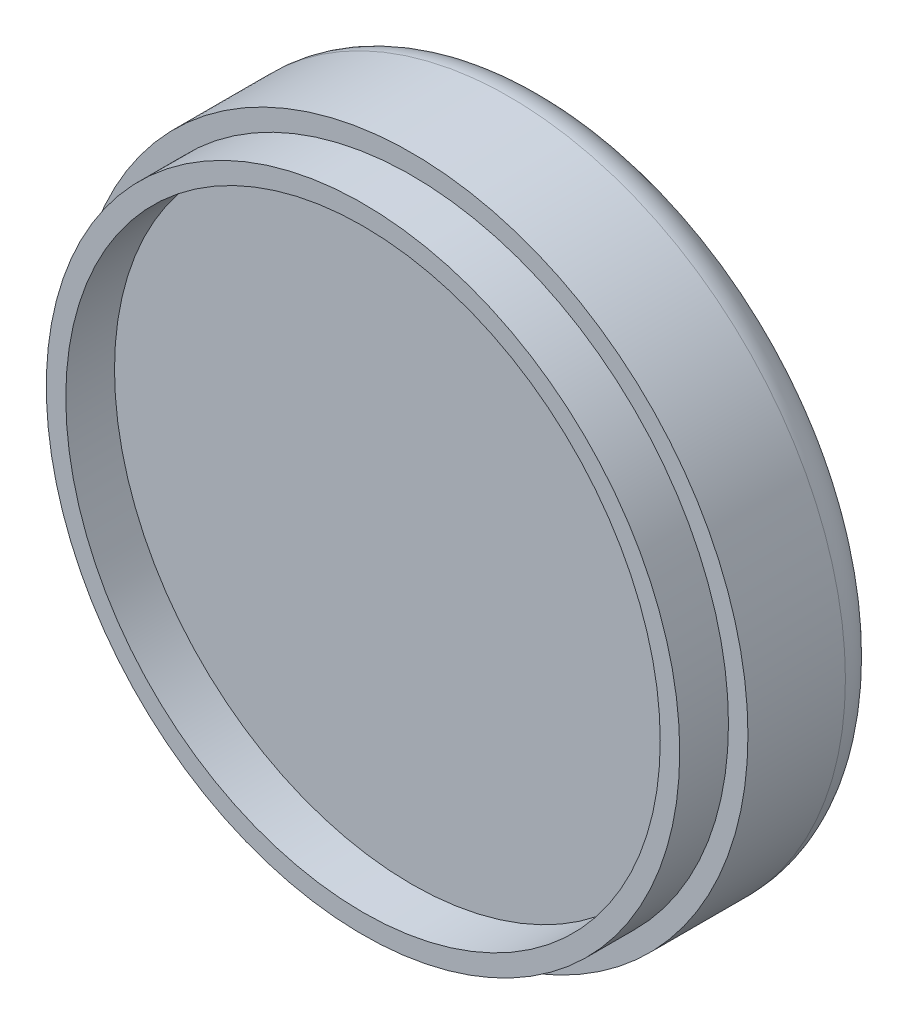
from build123d import *

# Parameters (mm, degrees)
ESQUISSE1_R        = 34.5
BOSS_EXTRU_1_DEPTH = 14
ESQUISSE2_R        = 32.5
ESQUISSE2_R_2      = 30.5
BOSS_EXTRU_2_DEPTH = 5
CONG_1_R           = 4


with BuildPart() as part:
    # Esquisse1 → Boss.-Extru.1 (new body)
    with BuildSketch(Plane.XY):
        Circle(ESQUISSE1_R)
    extrude(amount=BOSS_EXTRU_1_DEPTH)

    # Esquisse2 → Boss.-Extru.2 (add)
    with BuildSketch(Plane.XY.offset(14)):
        Circle(ESQUISSE2_R)
        Circle(ESQUISSE2_R_2, mode=Mode.SUBTRACT)
    extrude(amount=BOSS_EXTRU_2_DEPTH)

    # Cong_1
    cong_1_edges = [part.edges().sort_by_distance(p)[0] for p in [
        (-34.5, 0, 0),
    ]]
    fillet(cong_1_edges, radius=CONG_1_R)


solid = part.part
